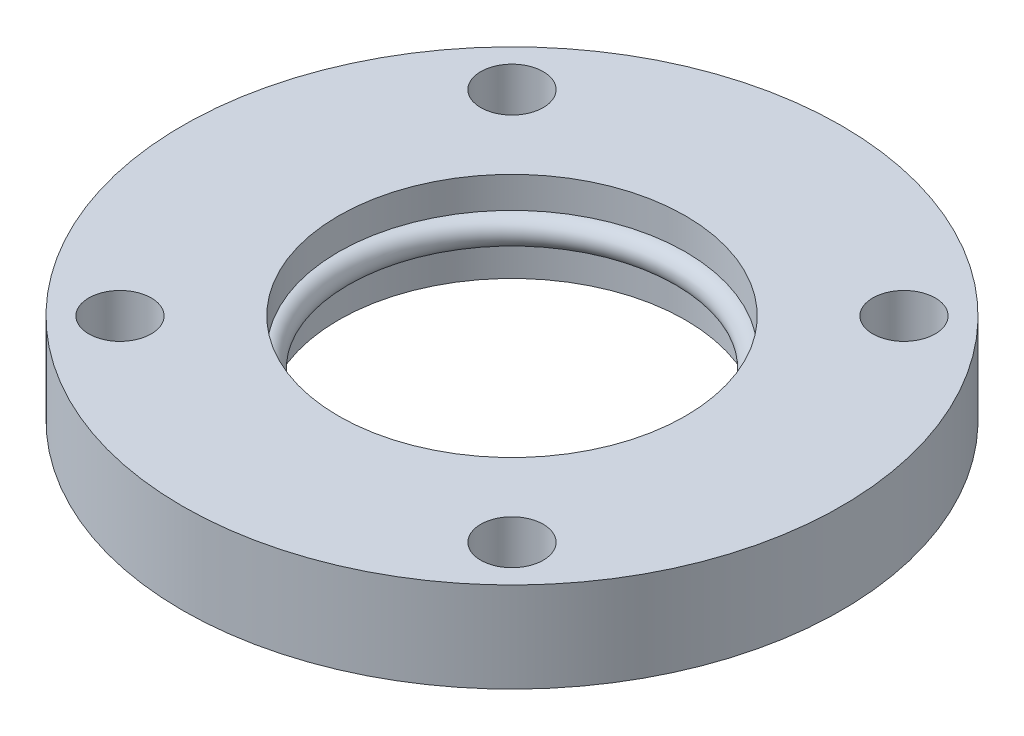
from build123d import *

# Parameters (mm, degrees)
SKETCH2_R           = 47.5
SKETCH2_R_2         = 25
SKETCH2_R_3         = 4.5
BOSS_EXTRUDE1_DEPTH = 6.5
SKETCH3_R           = 2


with BuildPart() as part:
    # Sketch2 → Boss-Extrude1 (new, symmetric)
    with BuildSketch(Plane(origin=(0, 0, 0), x_dir=(1, 0, 0), z_dir=(0, 1, 0))):
        with Locations(Location((0, 0, 0), (0, 0, 90))):
            Circle(SKETCH2_R)
        with Locations(Location((0, 0, 0), (0, 0, 90))):
            Circle(SKETCH2_R_2, mode=Mode.SUBTRACT)
        with Locations(Location((-28.25, 28.25, 0), (0, 0, 90))):
            Circle(SKETCH2_R_3, mode=Mode.SUBTRACT)
        with Locations(Location((28.25, 28.25, 0), (0, 0, 90))):
            Circle(SKETCH2_R_3, mode=Mode.SUBTRACT)
        with Locations(Location((28.25, -28.25, 0), (0, 0, 90))):
            Circle(SKETCH2_R_3, mode=Mode.SUBTRACT)
        with Locations(Location((-28.25, -28.25, 0), (0, 0, 90))):
            Circle(SKETCH2_R_3, mode=Mode.SUBTRACT)
    extrude(amount=BOSS_EXTRUDE1_DEPTH, both=True)

    # Sketch3 → Revolve2 (revolve)
    with BuildSketch(Plane.XY, mode=Mode.PRIVATE) as revolve2_sk:
        with Locations((-25, 0)):
            Circle(SKETCH3_R)
    revolve(revolve2_sk.sketch.rotate(Axis((0, 0, 0), (0, 1, 0)), 270), axis=Axis((0, 0, 0), (0, 1, 0)))


solid = part.part
